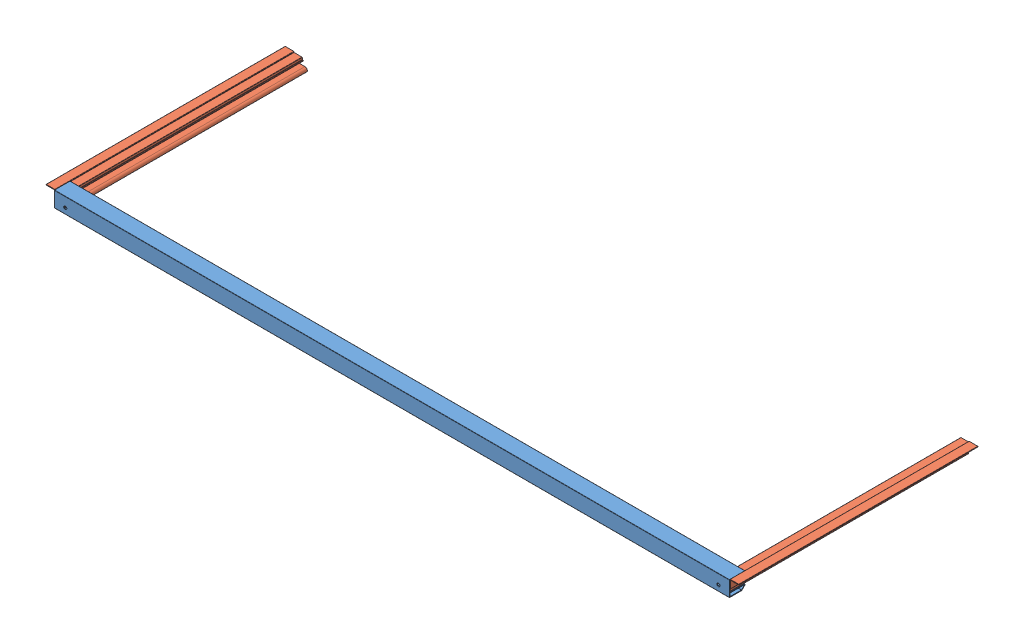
SolidWorks assembly BasPorte.SLDASM, configuration Défaut (file format 9000). Lengths in mm.
Overall size (1116 25.4 386).
3 component instances, 2 part files, 6 mates.
Components (placement in the parent):
- FaceChar-1: FaceChar.SLDPRT [Défaut] at (-587.9821 -47.9205 1099.7) size (1087 25 25.4)
- LongePorteverticale-1: LongePorteverticale.SLDPRT [Défaut] at (-588.9821 -23.5205 713.7) size (36 18.4 385)
- LongePorteverticale-2: LongePorteverticale.SLDPRT [Défaut] at (500.0179 -23.5205 1098.7) x (-1 0 0) z (0 0 -1) size (36 18.4 385)
Mates (geometry in assembly coordinates):
- Coïncidente2: coincident anti-aligned: plane of FaceChar-1 through (499.0179 -23.9205 1074.7) normal (0 -1 0); plane of LongePorteverticale-1 through (-587.9821 -23.9205 1098.7) normal (0 1 0)
- Coïncidente3: coincident anti-aligned: plane of FaceChar-1 through (-587.9821 -47.5205 1099.3) normal (-1 0 0); plane of LongePorteverticale-1 through (-587.9821 -22.9205 1098.7) normal (1 0 0)
- Coïncidente4: coincident anti-aligned: plane of FaceChar-1 through (499.0179 -24.1705 1098.7) normal (0 0 -1); plane of LongePorteverticale-1 through (-588.5821 -35.4205 1098.7) normal (0 0 1)
- Coïncidente5: coincident anti-aligned: plane of FaceChar-1 through (499.0179 -23.9205 1074.7) normal (0 -1 0); plane of LongePorteverticale-2 through (499.0179 -23.9205 713.7) normal (0 1 0)
- Coïncidente6: coincident anti-aligned: plane of FaceChar-1 through (499.0179 -24.1705 1098.7) normal (0 0 -1); plane of LongePorteverticale-2 through (499.6179 -35.4205 1098.7) normal (0 0 1)
- Coïncidente7: coincident anti-aligned: plane of FaceChar-1 through (499.0179 -47.5205 1099.3) normal (1 0 0); plane of LongePorteverticale-2 through (499.0179 -22.9205 713.7) normal (-1 0 0)
